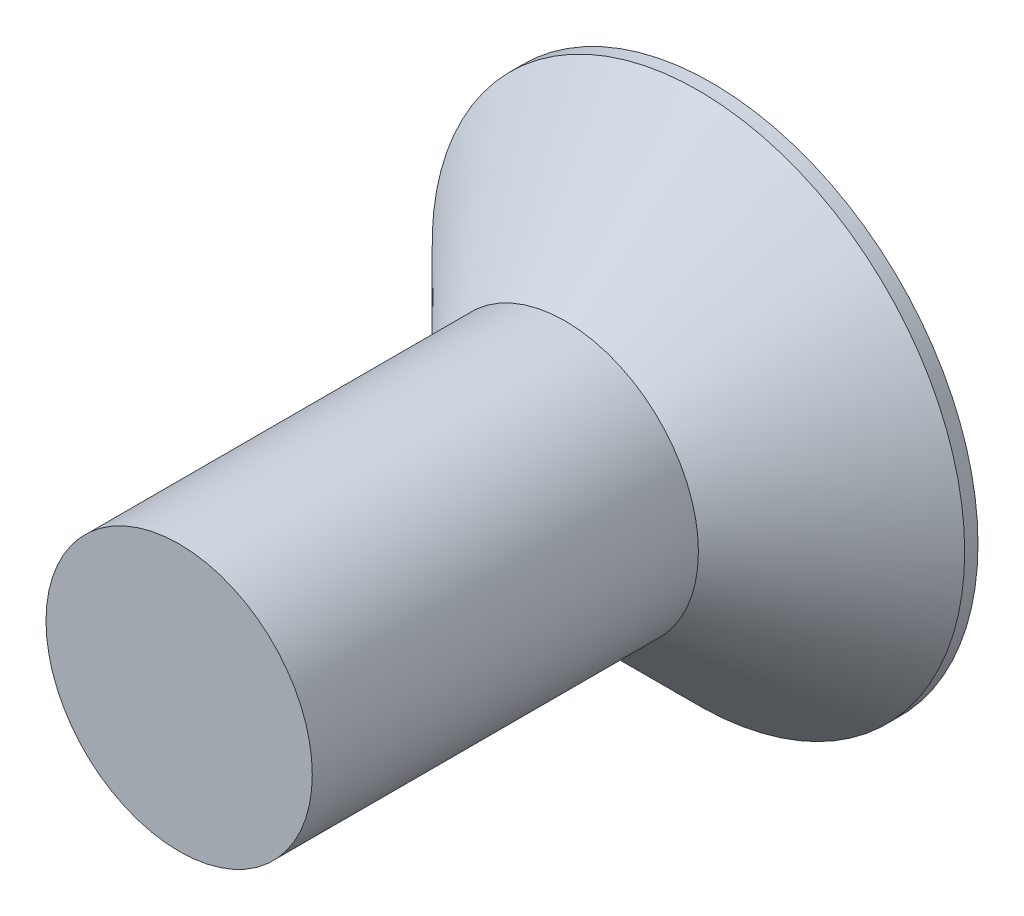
from build123d import *

# Parameters (mm, degrees)
HEX_2_DEPTH = 4


with BuildPart() as part:
    # Sketch6 → Revolve1 (revolve)
    with BuildSketch(Plane(origin=(0, 0, 0), x_dir=(0, 0, -1), z_dir=(1, 0, 0)), mode=Mode.PRIVATE) as revolve1_sk:
        Polygon((-16, 0), (-16, -4), (-4.4, -4), (-0.4, -8), (0, -8), (0, 0), align=None)
    revolve(revolve1_sk.sketch.rotate(Axis((0, 0, 16), (0, 0, -1)), 270), axis=Axis((0, 0, 16), (0, 0, -1)))

    # Sketch7 → HEX 2 (cut)
    with BuildSketch(Plane(origin=(0, 0, 0), x_dir=(-1, 0, 0), z_dir=(0, 0, -1))):
        Polygon((-2.5, 1.443375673), (-2.5, -1.443375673), (0, -2.886751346), (2.5, -1.443375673), (2.5, 1.443375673), (0, 2.886751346), align=None)
    extrude(amount=-HEX_2_DEPTH, mode=Mode.SUBTRACT)


solid = part.part
